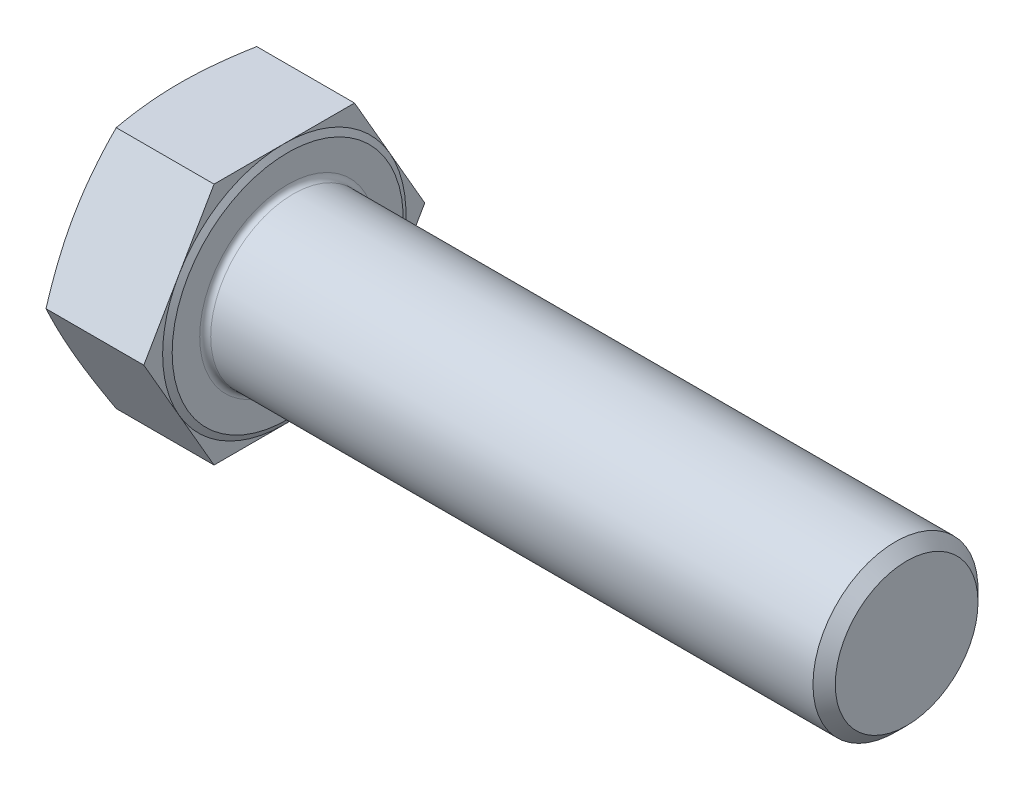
ISO-10303-21;
HEADER;
FILE_DESCRIPTION(('STEP AP214'),'2;1');
FILE_NAME('part.step','',(''),(''),'','','');
FILE_SCHEMA(('AUTOMOTIVE_DESIGN { 1 0 10303 214 1 1 1 1 }'));
ENDSEC;
DATA;
#1=APPLICATION_CONTEXT('core data for automotive mechanical design processes');
#2=APPLICATION_PROTOCOL_DEFINITION('international standard','automotive_design',2000,#1);
#3=PRODUCT_CONTEXT('',#1,'mechanical');
#4=PRODUCT('Part','Part','',(#3));
#5=PRODUCT_RELATED_PRODUCT_CATEGORY('part','',(#4));
#6=PRODUCT_DEFINITION_FORMATION('','',#4);
#7=PRODUCT_DEFINITION_CONTEXT('part definition',#1,'design');
#8=PRODUCT_DEFINITION('design','',#6,#7);
#9=PRODUCT_DEFINITION_SHAPE('','',#8);
#10=(LENGTH_UNIT() NAMED_UNIT(*) SI_UNIT(.MILLI.,.METRE.));
#11=(NAMED_UNIT(*) PLANE_ANGLE_UNIT() SI_UNIT($,.RADIAN.));
#12=(NAMED_UNIT(*) SI_UNIT($,.STERADIAN.) SOLID_ANGLE_UNIT());
#13=UNCERTAINTY_MEASURE_WITH_UNIT(LENGTH_MEASURE(1.E-05),#10,'distance_accuracy_value','');
#14=(GEOMETRIC_REPRESENTATION_CONTEXT(3) GLOBAL_UNCERTAINTY_ASSIGNED_CONTEXT((#13)) GLOBAL_UNIT_ASSIGNED_CONTEXT((#10,
#11,#12)) REPRESENTATION_CONTEXT('',''));
#15=CARTESIAN_POINT('',(0.,0.,0.));
#16=DIRECTION('',(0.,0.,1.));
#17=DIRECTION('',(1.,0.,0.));
#18=AXIS2_PLACEMENT_3D('',#15,#16,#17);
#19=CARTESIAN_POINT('',(15.72,0.,0.));
#20=DIRECTION('',(1.,0.,0.));
#21=DIRECTION('',(0.,0.,-1.));
#22=AXIS2_PLACEMENT_3D('',#19,#20,#21);
#23=PLANE('',#22);
#24=CARTESIAN_POINT('',(15.72,0.,0.));
#25=DIRECTION('',(1.,0.,0.));
#26=DIRECTION('',(0.,0.,-1.));
#27=AXIS2_PLACEMENT_3D('',#24,#25,#26);
#28=CIRCLE('',#27,12.8);
#29=CARTESIAN_POINT('',(15.72,0.,-12.8));
#30=VERTEX_POINT('',#29);
#31=EDGE_CURVE('E188',#30,#30,#28,.F.);
#32=ORIENTED_EDGE('',*,*,#31,.T.);
#33=EDGE_LOOP('',(#32));
#34=FACE_BOUND('',#33,.T.);
#35=CARTESIAN_POINT('',(15.72,0.,0.));
#36=DIRECTION('',(-1.,0.,0.));
#37=DIRECTION('',(0.,0.,1.));
#38=AXIS2_PLACEMENT_3D('',#35,#36,#37);
#39=CIRCLE('',#38,16.805);
#40=CARTESIAN_POINT('',(15.72,0.,16.805));
#41=VERTEX_POINT('',#40);
#42=EDGE_CURVE('E138',#41,#41,#39,.T.);
#43=ORIENTED_EDGE('',*,*,#42,.F.);
#44=EDGE_LOOP('',(#43));
#45=FACE_BOUND('',#44,.T.);
#46=ADVANCED_FACE('F33',(#34,#45),#23,.T.);
#47=CARTESIAN_POINT('',(15.22,-35.38,0.));
#48=DIRECTION('',(-1.,0.,0.));
#49=DIRECTION('',(0.,0.,1.));
#50=AXIS2_PLACEMENT_3D('',#47,#48,#49);
#51=PLANE('',#50);
#52=DIRECTION('',(0.,-0.866025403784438,0.5));
#53=VECTOR('',#52,1.);
#54=CARTESIAN_POINT('',(15.22,17.69,10.2133262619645));
#55=LINE('',#54,#53);
#56=CARTESIAN_POINT('',(15.22,17.69,10.2133262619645));
#57=VERTEX_POINT('',#56);
#58=CARTESIAN_POINT('',(15.22,8.845,15.3199893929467));
#59=VERTEX_POINT('',#58);
#60=EDGE_CURVE('E137',#57,#59,#55,.T.);
#61=ORIENTED_EDGE('',*,*,#60,.T.);
#62=CARTESIAN_POINT('',(15.22,0.,0.));
#63=DIRECTION('',(-1.,0.,0.));
#64=DIRECTION('',(0.,0.,1.));
#65=AXIS2_PLACEMENT_3D('',#62,#63,#64);
#66=CIRCLE('',#65,17.69);
#67=CARTESIAN_POINT('',(15.22,17.69,0.));
#68=VERTEX_POINT('',#67);
#69=EDGE_CURVE('E49',#59,#68,#66,.T.);
#70=ORIENTED_EDGE('',*,*,#69,.T.);
#71=DIRECTION('',(0.,0.,1.));
#72=VECTOR('',#71,1.);
#73=CARTESIAN_POINT('',(15.22,17.69,-10.2133262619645));
#74=LINE('',#73,#72);
#75=EDGE_CURVE('E134',#68,#57,#74,.T.);
#76=ORIENTED_EDGE('',*,*,#75,.T.);
#77=EDGE_LOOP('',(#61,#70,#76));
#78=FACE_BOUND('',#77,.T.);
#79=ADVANCED_FACE('F133',(#78),#51,.F.);
#80=CARTESIAN_POINT('',(15.22,17.69,-10.2133262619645));
#81=VERTEX_POINT('',#80);
#82=EDGE_CURVE('E145',#81,#68,#74,.T.);
#83=ORIENTED_EDGE('',*,*,#82,.T.);
#84=CARTESIAN_POINT('',(15.22,8.845,-15.3199893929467));
#85=VERTEX_POINT('',#84);
#86=EDGE_CURVE('E121',#68,#85,#66,.T.);
#87=ORIENTED_EDGE('',*,*,#86,.T.);
#88=DIRECTION('',(0.,0.866025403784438,0.5));
#89=VECTOR('',#88,1.);
#90=CARTESIAN_POINT('',(15.22,0.,-20.426652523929));
#91=LINE('',#90,#89);
#92=EDGE_CURVE('E151',#85,#81,#91,.T.);
#93=ORIENTED_EDGE('',*,*,#92,.T.);
#94=EDGE_LOOP('',(#83,#87,#93));
#95=FACE_BOUND('',#94,.T.);
#96=ADVANCED_FACE('F150',(#95),#51,.F.);
#97=CARTESIAN_POINT('',(15.22,0.,-20.426652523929));
#98=VERTEX_POINT('',#97);
#99=EDGE_CURVE('E148',#98,#85,#91,.T.);
#100=ORIENTED_EDGE('',*,*,#99,.T.);
#101=CARTESIAN_POINT('',(15.22,-8.845,-15.3199893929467));
#102=VERTEX_POINT('',#101);
#103=EDGE_CURVE('E124',#85,#102,#66,.T.);
#104=ORIENTED_EDGE('',*,*,#103,.T.);
#105=DIRECTION('',(0.,0.866025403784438,-0.5));
#106=VECTOR('',#105,1.);
#107=CARTESIAN_POINT('',(15.22,-17.69,-10.2133262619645));
#108=LINE('',#107,#106);
#109=EDGE_CURVE('E348',#102,#98,#108,.T.);
#110=ORIENTED_EDGE('',*,*,#109,.T.);
#111=EDGE_LOOP('',(#100,#104,#110));
#112=FACE_BOUND('',#111,.T.);
#113=ADVANCED_FACE('F302',(#112),#51,.F.);
#114=CARTESIAN_POINT('',(15.22,-17.69,-10.2133262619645));
#115=VERTEX_POINT('',#114);
#116=EDGE_CURVE('E316',#115,#102,#108,.T.);
#117=ORIENTED_EDGE('',*,*,#116,.T.);
#118=CARTESIAN_POINT('',(15.22,-17.69,0.));
#119=VERTEX_POINT('',#118);
#120=EDGE_CURVE('E317',#102,#119,#66,.T.);
#121=ORIENTED_EDGE('',*,*,#120,.T.);
#122=DIRECTION('',(0.,0.,-1.));
#123=VECTOR('',#122,1.);
#124=CARTESIAN_POINT('',(15.22,-17.69,10.2133262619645));
#125=LINE('',#124,#123);
#126=EDGE_CURVE('E162',#119,#115,#125,.T.);
#127=ORIENTED_EDGE('',*,*,#126,.T.);
#128=EDGE_LOOP('',(#117,#121,#127));
#129=FACE_BOUND('',#128,.T.);
#130=ADVANCED_FACE('F295',(#129),#51,.F.);
#131=CARTESIAN_POINT('',(15.22,-17.69,10.2133262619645));
#132=VERTEX_POINT('',#131);
#133=EDGE_CURVE('E163',#132,#119,#125,.T.);
#134=ORIENTED_EDGE('',*,*,#133,.T.);
#135=CARTESIAN_POINT('',(15.22,-8.84500000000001,15.3199893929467));
#136=VERTEX_POINT('',#135);
#137=EDGE_CURVE('E306',#119,#136,#66,.T.);
#138=ORIENTED_EDGE('',*,*,#137,.T.);
#139=DIRECTION('',(0.,-0.866025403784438,-0.500000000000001));
#140=VECTOR('',#139,1.);
#141=CARTESIAN_POINT('',(15.22,0.,20.426652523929));
#142=LINE('',#141,#140);
#143=EDGE_CURVE('E158',#136,#132,#142,.T.);
#144=ORIENTED_EDGE('',*,*,#143,.T.);
#145=EDGE_LOOP('',(#134,#138,#144));
#146=FACE_BOUND('',#145,.T.);
#147=ADVANCED_FACE('F287',(#146),#51,.F.);
#148=CARTESIAN_POINT('',(15.22,-17.69,-10.2133262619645));
#149=DIRECTION('',(0.,0.5,0.866025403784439));
#150=DIRECTION('',(0.,-0.866025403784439,0.5));
#151=AXIS2_PLACEMENT_3D('',#148,#149,#150);
#152=PLANE('',#151);
#153=CARTESIAN_POINT('',(0.996102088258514,0.00020000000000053,-20.4267679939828));
#154=CARTESIAN_POINT('',(0.919123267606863,-0.36615036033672,-20.2152555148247));
#155=CARTESIAN_POINT('',(0.845606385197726,-0.733039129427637,-20.0034321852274));
#156=CARTESIAN_POINT('',(0.706258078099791,-1.46794347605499,-19.5791349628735));
#157=CARTESIAN_POINT('',(0.640427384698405,-1.83595915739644,-19.366661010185));
#158=CARTESIAN_POINT('',(0.455543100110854,-2.94217643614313,-18.7279861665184));
#159=CARTESIAN_POINT('',(0.349205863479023,-3.68204182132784,-18.3008246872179));
#160=CARTESIAN_POINT('',(0.219971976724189,-4.7909114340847,-17.6606185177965));
#161=CARTESIAN_POINT('',(0.182048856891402,-5.15863629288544,-17.4483124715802));
#162=CARTESIAN_POINT('',(0.116558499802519,-5.89477259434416,-17.0233039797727));
#163=CARTESIAN_POINT('',(0.0889908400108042,-6.26318400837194,-16.8106015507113));
#164=CARTESIAN_POINT('',(0.0446929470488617,-7.00036960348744,-16.3849872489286));
#165=CARTESIAN_POINT('',(0.0279590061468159,-7.36914361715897,-16.1720754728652));
#166=CARTESIAN_POINT('',(0.00561254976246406,-8.10694508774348,-15.7461055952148));
#167=CARTESIAN_POINT('',(0.,-8.47597254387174,-15.5330474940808));
#168=CARTESIAN_POINT('',(0.,-9.21402745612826,-15.1069312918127));
#169=CARTESIAN_POINT('',(0.00561254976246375,-9.58305491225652,-14.8938731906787));
#170=CARTESIAN_POINT('',(0.0279590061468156,-10.320856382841,-14.4679033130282));
#171=CARTESIAN_POINT('',(0.0446929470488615,-10.6896303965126,-14.2549915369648));
#172=CARTESIAN_POINT('',(0.0889908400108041,-11.4268159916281,-13.8293772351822));
#173=CARTESIAN_POINT('',(0.116558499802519,-11.7952274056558,-13.6166748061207));
#174=CARTESIAN_POINT('',(0.182048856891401,-12.5313637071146,-13.1916663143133));
#175=CARTESIAN_POINT('',(0.219971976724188,-12.8990885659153,-12.979360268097));
#176=CARTESIAN_POINT('',(0.349205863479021,-14.0079581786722,-12.3391540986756));
#177=CARTESIAN_POINT('',(0.455543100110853,-14.7478235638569,-11.9119926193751));
#178=CARTESIAN_POINT('',(0.640427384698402,-15.8540408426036,-11.2733177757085));
#179=CARTESIAN_POINT('',(0.706258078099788,-16.222056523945,-11.06084382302));
#180=CARTESIAN_POINT('',(0.845606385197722,-16.9569608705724,-10.6365466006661));
#181=CARTESIAN_POINT('',(0.919123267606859,-17.3238496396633,-10.4247232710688));
#182=CARTESIAN_POINT('',(0.996102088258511,-17.6902,-10.2132107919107));
#183=B_SPLINE_CURVE_WITH_KNOTS('',3,(#153,#154,#155,#156,#157,#158,#159,#160,#161,#162,#163,
#164,#165,#166,#167,#168,#169,#170,#171,#172,#173,#174,#175,#176,#177,#178,#179,#180,#181,#182),
.UNSPECIFIED.,.F.,.F.,(4,2,2,2,2,2,2,2,2,2,2,2,2,2,4),(0.,1.28987745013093,2.57987752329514,
5.16166096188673,6.44046679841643,7.71922044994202,8.9975362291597,10.2758480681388,
11.554159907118,12.8324756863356,14.1112293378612,15.3900351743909,17.9718186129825,
19.2618186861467,20.5516961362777),.UNSPECIFIED.);
#184=CARTESIAN_POINT('',(0.996060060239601,0.,-20.426652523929));
#185=VERTEX_POINT('',#184);
#186=CARTESIAN_POINT('',(0.,-8.84500000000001,-15.3199893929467));
#187=VERTEX_POINT('',#186);
#188=EDGE_CURVE('E332',#185,#187,#183,.T.);
#189=ORIENTED_EDGE('',*,*,#188,.F.);
#190=DIRECTION('',(-1.,0.,0.));
#191=VECTOR('',#190,1.);
#192=CARTESIAN_POINT('',(15.22,0.,-20.426652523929));
#193=LINE('',#192,#191);
#194=EDGE_CURVE('E178',#98,#185,#193,.T.);
#195=ORIENTED_EDGE('',*,*,#194,.F.);
#196=ORIENTED_EDGE('',*,*,#109,.F.);
#197=ORIENTED_EDGE('',*,*,#116,.F.);
#198=DIRECTION('',(-1.,0.,0.));
#199=VECTOR('',#198,1.);
#200=CARTESIAN_POINT('',(15.22,-17.69,-10.2133262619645));
#201=LINE('',#200,#199);
#202=CARTESIAN_POINT('',(0.996060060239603,-17.69,-10.2133262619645));
#203=VERTEX_POINT('',#202);
#204=EDGE_CURVE('E166',#115,#203,#201,.T.);
#205=ORIENTED_EDGE('',*,*,#204,.T.);
#206=EDGE_CURVE('E245',#187,#203,#183,.T.);
#207=ORIENTED_EDGE('',*,*,#206,.F.);
#208=EDGE_LOOP('',(#189,#195,#196,#197,#205,#207));
#209=FACE_BOUND('',#208,.T.);
#210=ADVANCED_FACE('F35',(#209),#152,.F.);
#211=CARTESIAN_POINT('',(15.22,0.,-20.426652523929));
#212=DIRECTION('',(0.,-0.5,0.866025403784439));
#213=DIRECTION('',(0.,-0.866025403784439,-0.5));
#214=AXIS2_PLACEMENT_3D('',#211,#212,#213);
#215=PLANE('',#214);
#216=CARTESIAN_POINT('',(0.996102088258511,17.6902,-10.2132107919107));
#217=CARTESIAN_POINT('',(0.919123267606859,17.3238496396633,-10.4247232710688));
#218=CARTESIAN_POINT('',(0.845606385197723,16.9569608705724,-10.6365466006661));
#219=CARTESIAN_POINT('',(0.706258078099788,16.222056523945,-11.06084382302));
#220=CARTESIAN_POINT('',(0.640427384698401,15.8540408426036,-11.2733177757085));
#221=CARTESIAN_POINT('',(0.455543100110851,14.7478235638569,-11.9119926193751));
#222=CARTESIAN_POINT('',(0.349205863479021,14.0079581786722,-12.3391540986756));
#223=CARTESIAN_POINT('',(0.219971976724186,12.8990885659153,-12.979360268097));
#224=CARTESIAN_POINT('',(0.182048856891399,12.5313637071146,-13.1916663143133));
#225=CARTESIAN_POINT('',(0.116558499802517,11.7952274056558,-13.6166748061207));
#226=CARTESIAN_POINT('',(0.0889908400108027,11.4268159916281,-13.8293772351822));
#227=CARTESIAN_POINT('',(0.0446929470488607,10.6896303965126,-14.2549915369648));
#228=CARTESIAN_POINT('',(0.0279590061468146,10.320856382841,-14.4679033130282));
#229=CARTESIAN_POINT('',(0.00561254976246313,9.58305491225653,-14.8938731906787));
#230=CARTESIAN_POINT('',(0.,9.21402745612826,-15.1069312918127));
#231=CARTESIAN_POINT('',(0.,8.47597254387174,-15.5330474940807));
#232=CARTESIAN_POINT('',(0.0056125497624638,8.10694508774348,-15.7461055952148));
#233=CARTESIAN_POINT('',(0.0279590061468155,7.36914361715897,-16.1720754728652));
#234=CARTESIAN_POINT('',(0.0446929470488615,7.00036960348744,-16.3849872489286));
#235=CARTESIAN_POINT('',(0.0889908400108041,6.26318400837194,-16.8106015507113));
#236=CARTESIAN_POINT('',(0.116558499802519,5.89477259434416,-17.0233039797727));
#237=CARTESIAN_POINT('',(0.182048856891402,5.15863629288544,-17.4483124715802));
#238=CARTESIAN_POINT('',(0.219971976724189,4.7909114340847,-17.6606185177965));
#239=CARTESIAN_POINT('',(0.349205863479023,3.68204182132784,-18.3008246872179));
#240=CARTESIAN_POINT('',(0.455543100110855,2.94217643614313,-18.7279861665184));
#241=CARTESIAN_POINT('',(0.640427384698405,1.83595915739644,-19.366661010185));
#242=CARTESIAN_POINT('',(0.706258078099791,1.46794347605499,-19.5791349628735));
#243=CARTESIAN_POINT('',(0.845606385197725,0.733039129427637,-20.0034321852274));
#244=CARTESIAN_POINT('',(0.919123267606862,0.36615036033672,-20.2152555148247));
#245=CARTESIAN_POINT('',(0.996102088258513,-0.000199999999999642,-20.4267679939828));
#246=B_SPLINE_CURVE_WITH_KNOTS('',3,(#216,#217,#218,#219,#220,#221,#222,#223,#224,#225,#226,
#227,#228,#229,#230,#231,#232,#233,#234,#235,#236,#237,#238,#239,#240,#241,#242,#243,#244,#245),
.UNSPECIFIED.,.F.,.F.,(4,2,2,2,2,2,2,2,2,2,2,2,2,2,4),(0.,1.28987745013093,2.57987752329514,
5.16166096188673,6.44046679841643,7.71922044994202,8.9975362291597,10.2758480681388,
11.554159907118,12.8324756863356,14.1112293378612,15.3900351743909,17.9718186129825,
19.2618186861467,20.5516961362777),.UNSPECIFIED.);
#247=CARTESIAN_POINT('',(0.996060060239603,17.69,-10.2133262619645));
#248=VERTEX_POINT('',#247);
#249=CARTESIAN_POINT('',(0.,8.84500000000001,-15.3199893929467));
#250=VERTEX_POINT('',#249);
#251=EDGE_CURVE('E260',#248,#250,#246,.T.);
#252=ORIENTED_EDGE('',*,*,#251,.F.);
#253=DIRECTION('',(-1.,0.,0.));
#254=VECTOR('',#253,1.);
#255=CARTESIAN_POINT('',(15.22,17.69,-10.2133262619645));
#256=LINE('',#255,#254);
#257=EDGE_CURVE('E176',#81,#248,#256,.T.);
#258=ORIENTED_EDGE('',*,*,#257,.F.);
#259=ORIENTED_EDGE('',*,*,#92,.F.);
#260=ORIENTED_EDGE('',*,*,#99,.F.);
#261=ORIENTED_EDGE('',*,*,#194,.T.);
#262=EDGE_CURVE('E256',#250,#185,#246,.T.);
#263=ORIENTED_EDGE('',*,*,#262,.F.);
#264=EDGE_LOOP('',(#252,#258,#259,#260,#261,#263));
#265=FACE_BOUND('',#264,.T.);
#266=ADVANCED_FACE('F266',(#265),#215,.F.);
#267=CARTESIAN_POINT('',(15.22,17.69,-10.2133262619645));
#268=DIRECTION('',(0.,-1.,0.));
#269=DIRECTION('',(0.,0.,-1.));
#270=AXIS2_PLACEMENT_3D('',#267,#268,#269);
#271=PLANE('',#270);
#272=CARTESIAN_POINT('',(5.32254994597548,17.69,-27.0412966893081));
#273=CARTESIAN_POINT('',(5.20066556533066,17.69,-26.64112277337));
#274=CARTESIAN_POINT('',(5.07951828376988,17.69,-26.2407244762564));
#275=CARTESIAN_POINT('',(4.83886293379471,17.69,-25.4394331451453));
#276=CARTESIAN_POINT('',(4.71935487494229,17.69,-25.0385401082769));
#277=CARTESIAN_POINT('',(4.36352164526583,17.69,-23.8349976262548));
#278=CARTESIAN_POINT('',(4.12990548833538,17.69,-23.0315439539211));
#279=CARTESIAN_POINT('',(3.67113367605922,17.69,-21.4205977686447));
#280=CARTESIAN_POINT('',(3.44599461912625,17.69,-20.613100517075));
#281=CARTESIAN_POINT('',(3.00679348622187,17.69,-18.9951026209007));
#282=CARTESIAN_POINT('',(2.7927312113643,17.69,-18.184602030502));
#283=CARTESIAN_POINT('',(2.38098718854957,17.69,-16.5700722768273));
#284=CARTESIAN_POINT('',(2.18313601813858,17.69,-15.7660865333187));
#285=CARTESIAN_POINT('',(1.80427806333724,17.69,-14.1541143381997));
#286=CARTESIAN_POINT('',(1.62327156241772,17.69,-13.3461278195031));
#287=CARTESIAN_POINT('',(1.28232330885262,17.69,-11.7259732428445));
#288=CARTESIAN_POINT('',(1.12237437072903,17.69,-10.9138067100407));
#289=CARTESIAN_POINT('',(0.828411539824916,17.69,-9.28475845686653));
#290=CARTESIAN_POINT('',(0.694396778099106,17.69,-8.46787689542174));
#291=CARTESIAN_POINT('',(0.47101607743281,17.69,-6.92138265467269));
#292=CARTESIAN_POINT('',(0.378328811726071,17.69,-6.19225422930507));
#293=CARTESIAN_POINT('',(0.221431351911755,17.69,-4.73091426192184));
#294=CARTESIAN_POINT('',(0.157220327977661,17.69,-3.99870281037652));
#295=CARTESIAN_POINT('',(0.0603676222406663,17.69,-2.53268198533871));
#296=CARTESIAN_POINT('',(0.0277036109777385,17.69,-1.79887411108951));
#297=CARTESIAN_POINT('',(-0.0044012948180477,17.69,-0.330524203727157));
#298=CARTESIAN_POINT('',(-0.00384242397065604,17.69,0.404017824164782));
#299=CARTESIAN_POINT('',(0.030555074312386,17.69,1.87603656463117));
#300=CARTESIAN_POINT('',(0.064562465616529,17.69,2.61350926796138));
#301=CARTESIAN_POINT('',(0.164291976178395,17.69,4.08628853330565));
#302=CARTESIAN_POINT('',(0.230014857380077,17.69,4.82159504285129));
#303=CARTESIAN_POINT('',(0.390100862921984,17.69,6.2896788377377));
#304=CARTESIAN_POINT('',(0.484488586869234,17.69,7.0224534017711));
#305=CARTESIAN_POINT('',(0.698075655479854,17.69,8.48433663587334));
#306=CARTESIAN_POINT('',(0.817275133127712,17.69,9.21344528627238));
#307=CARTESIAN_POINT('',(1.08346543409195,17.69,10.7063636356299));
#308=CARTESIAN_POINT('',(1.23159277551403,17.69,11.4699688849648));
#309=CARTESIAN_POINT('',(1.54691232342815,17.69,12.9932580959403));
#310=CARTESIAN_POINT('',(1.71410596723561,17.69,13.7529417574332));
#311=CARTESIAN_POINT('',(2.0640473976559,17.69,15.2689291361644));
#312=CARTESIAN_POINT('',(2.24679970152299,17.69,16.0252318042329));
#313=CARTESIAN_POINT('',(2.62488561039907,17.69,17.5346511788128));
#314=CARTESIAN_POINT('',(2.82021891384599,17.69,18.2877679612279));
#315=CARTESIAN_POINT('',(3.22137256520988,17.69,19.792229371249));
#316=CARTESIAN_POINT('',(3.42720605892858,17.69,20.5435704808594));
#317=CARTESIAN_POINT('',(3.84724615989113,17.69,22.0439053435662));
#318=CARTESIAN_POINT('',(4.06145280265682,17.69,22.7928990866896));
#319=CARTESIAN_POINT('',(4.49670654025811,17.69,24.2887557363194));
#320=CARTESIAN_POINT('',(4.71775248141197,17.69,25.0356189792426));
#321=CARTESIAN_POINT('',(5.16553110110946,17.69,26.5276341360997));
#322=CARTESIAN_POINT('',(5.39226376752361,17.69,27.27278605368));
#323=CARTESIAN_POINT('',(5.84793743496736,17.69,28.7534099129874));
#324=CARTESIAN_POINT('',(6.07682640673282,17.69,29.4888978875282));
#325=CARTESIAN_POINT('',(6.53850831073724,17.69,30.958648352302));
#326=CARTESIAN_POINT('',(6.77130125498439,17.69,31.6929108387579));
#327=CARTESIAN_POINT('',(7.47463001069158,17.69,33.894187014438));
#328=CARTESIAN_POINT('',(7.95009616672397,17.69,35.3596261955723));
#329=CARTESIAN_POINT('',(8.66958601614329,17.69,37.5526335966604));
#330=CARTESIAN_POINT('',(8.90999982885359,17.69,38.2813921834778));
#331=CARTESIAN_POINT('',(9.39290673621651,17.69,39.7382212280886));
#332=CARTESIAN_POINT('',(9.63539983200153,17.69,40.466291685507));
#333=CARTESIAN_POINT('',(10.1221661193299,17.69,41.9217705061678));
#334=CARTESIAN_POINT('',(10.366439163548,17.69,42.6491789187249));
#335=CARTESIAN_POINT('',(10.8565658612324,17.69,44.1034611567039));
#336=CARTESIAN_POINT('',(11.102419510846,17.69,44.8303349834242));
#337=CARTESIAN_POINT('',(11.3489545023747,17.69,45.556977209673));
#338=B_SPLINE_CURVE_WITH_KNOTS('',3,(#272,#273,#274,#275,#276,#277,#278,#279,#280,#281,#282,
#283,#284,#285,#286,#287,#288,#289,#290,#291,#292,#293,#294,#295,#296,#297,#298,#299,#300,#301,
#302,#303,#304,#305,#306,#307,#308,#309,#310,#311,#312,#313,#314,#315,#316,#317,#318,#319,#320,
#321,#322,#323,#324,#325,#326,#327,#328,#329,#330,#331,#332,#333,#334,#335,#336,#337),
.UNSPECIFIED.,.F.,.F.,(4,2,2,2,2,2,2,2,2,2,2,2,2,2,2,2,2,2,2,2,2,2,2,2,2,2,2,2,2,2,2,2,4),(0.,
1.25497065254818,2.50994862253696,5.02009008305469,7.53491484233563,10.0496944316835,
12.53346810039,15.0172835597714,17.5002492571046,19.9831317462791,22.1876358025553,
24.3920756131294,26.5949539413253,28.7978167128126,31.0118513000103,33.2259390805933,
35.4419323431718,37.6579374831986,39.9911583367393,42.3245551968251,44.6586318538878,
46.9926525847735,49.3296707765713,51.6666988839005,54.0033348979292,56.339965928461,
58.6507957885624,60.9616327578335,65.5835052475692,67.8856747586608,70.1878455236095,
72.4898278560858,74.7918045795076),.UNSPECIFIED.);
#339=CARTESIAN_POINT('',(0.996060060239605,17.6900000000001,10.2133262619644));
#340=VERTEX_POINT('',#339);
#341=CARTESIAN_POINT('',(0.,17.69,0.));
#342=VERTEX_POINT('',#341);
#343=EDGE_CURVE('E349',#340,#342,#338,.F.);
#344=ORIENTED_EDGE('',*,*,#343,.F.);
#345=DIRECTION('',(-1.,0.,0.));
#346=VECTOR('',#345,1.);
#347=CARTESIAN_POINT('',(15.22,17.69,10.2133262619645));
#348=LINE('',#347,#346);
#349=EDGE_CURVE('E147',#57,#340,#348,.T.);
#350=ORIENTED_EDGE('',*,*,#349,.F.);
#351=ORIENTED_EDGE('',*,*,#75,.F.);
#352=ORIENTED_EDGE('',*,*,#82,.F.);
#353=ORIENTED_EDGE('',*,*,#257,.T.);
#354=EDGE_CURVE('E261',#342,#248,#338,.F.);
#355=ORIENTED_EDGE('',*,*,#354,.F.);
#356=EDGE_LOOP('',(#344,#350,#351,#352,#353,#355));
#357=FACE_BOUND('',#356,.T.);
#358=ADVANCED_FACE('F143',(#357),#271,.F.);
#359=CARTESIAN_POINT('',(15.22,17.69,10.2133262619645));
#360=DIRECTION('',(0.,-0.5,-0.866025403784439));
#361=DIRECTION('',(0.,0.866025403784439,-0.5));
#362=AXIS2_PLACEMENT_3D('',#359,#360,#361);
#363=PLANE('',#362);
#364=CARTESIAN_POINT('',(0.996102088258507,-0.000199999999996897,20.4267679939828));
#365=CARTESIAN_POINT('',(0.919123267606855,0.366150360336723,20.2152555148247));
#366=CARTESIAN_POINT('',(0.845606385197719,0.733039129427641,20.0034321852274));
#367=CARTESIAN_POINT('',(0.706258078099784,1.46794347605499,19.5791349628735));
#368=CARTESIAN_POINT('',(0.640427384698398,1.83595915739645,19.366661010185));
#369=CARTESIAN_POINT('',(0.455543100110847,2.94217643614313,18.7279861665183));
#370=CARTESIAN_POINT('',(0.349205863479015,3.68204182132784,18.3008246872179));
#371=CARTESIAN_POINT('',(0.219971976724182,4.79091143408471,17.6606185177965));
#372=CARTESIAN_POINT('',(0.182048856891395,5.15863629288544,17.4483124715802));
#373=CARTESIAN_POINT('',(0.116558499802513,5.89477259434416,17.0233039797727));
#374=CARTESIAN_POINT('',(0.0889908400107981,6.26318400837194,16.8106015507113));
#375=CARTESIAN_POINT('',(0.0446929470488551,7.00036960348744,16.3849872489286));
#376=CARTESIAN_POINT('',(0.0279590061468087,7.36914361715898,16.1720754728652));
#377=CARTESIAN_POINT('',(0.00561254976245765,8.10694508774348,15.7461055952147));
#378=CARTESIAN_POINT('',(0.,8.47597254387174,15.5330474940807));
#379=CARTESIAN_POINT('',(0.,9.21402745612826,15.1069312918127));
#380=CARTESIAN_POINT('',(0.00561254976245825,9.58305491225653,14.8938731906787));
#381=CARTESIAN_POINT('',(0.0279590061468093,10.320856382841,14.4679033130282));
#382=CARTESIAN_POINT('',(0.0446929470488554,10.6896303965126,14.2549915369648));
#383=CARTESIAN_POINT('',(0.0889908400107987,11.4268159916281,13.8293772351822));
#384=CARTESIAN_POINT('',(0.116558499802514,11.7952274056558,13.6166748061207));
#385=CARTESIAN_POINT('',(0.182048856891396,12.5313637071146,13.1916663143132));
#386=CARTESIAN_POINT('',(0.219971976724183,12.8990885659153,12.9793602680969));
#387=CARTESIAN_POINT('',(0.349205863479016,14.0079581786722,12.3391540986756));
#388=CARTESIAN_POINT('',(0.455543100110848,14.7478235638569,11.9119926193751));
#389=CARTESIAN_POINT('',(0.640427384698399,15.8540408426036,11.2733177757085));
#390=CARTESIAN_POINT('',(0.706258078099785,16.222056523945,11.06084382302));
#391=CARTESIAN_POINT('',(0.845606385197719,16.9569608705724,10.636546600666));
#392=CARTESIAN_POINT('',(0.919123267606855,17.3238496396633,10.4247232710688));
#393=CARTESIAN_POINT('',(0.996102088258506,17.6902,10.2132107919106));
#394=B_SPLINE_CURVE_WITH_KNOTS('',3,(#364,#365,#366,#367,#368,#369,#370,#371,#372,#373,#374,
#375,#376,#377,#378,#379,#380,#381,#382,#383,#384,#385,#386,#387,#388,#389,#390,#391,#392,#393),
.UNSPECIFIED.,.F.,.F.,(4,2,2,2,2,2,2,2,2,2,2,2,2,2,4),(0.,1.28987745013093,2.57987752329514,
5.16166096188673,6.44046679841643,7.71922044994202,8.9975362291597,10.2758480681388,
11.554159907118,12.8324756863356,14.1112293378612,15.3900351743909,17.9718186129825,
19.2618186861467,20.5516961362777),.UNSPECIFIED.);
#395=CARTESIAN_POINT('',(0.996060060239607,0.,20.426652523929));
#396=VERTEX_POINT('',#395);
#397=CARTESIAN_POINT('',(0.,8.845,15.3199893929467));
#398=VERTEX_POINT('',#397);
#399=EDGE_CURVE('E250',#396,#398,#394,.T.);
#400=ORIENTED_EDGE('',*,*,#399,.F.);
#401=DIRECTION('',(-1.,0.,0.));
#402=VECTOR('',#401,1.);
#403=CARTESIAN_POINT('',(15.22,0.,20.426652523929));
#404=LINE('',#403,#402);
#405=CARTESIAN_POINT('',(15.22,0.,20.426652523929));
#406=VERTEX_POINT('',#405);
#407=EDGE_CURVE('E172',#406,#396,#404,.T.);
#408=ORIENTED_EDGE('',*,*,#407,.F.);
#409=EDGE_CURVE('E153',#59,#406,#55,.T.);
#410=ORIENTED_EDGE('',*,*,#409,.F.);
#411=ORIENTED_EDGE('',*,*,#60,.F.);
#412=ORIENTED_EDGE('',*,*,#349,.T.);
#413=EDGE_CURVE('E335',#398,#340,#394,.T.);
#414=ORIENTED_EDGE('',*,*,#413,.F.);
#415=EDGE_LOOP('',(#400,#408,#410,#411,#412,#414));
#416=FACE_BOUND('',#415,.T.);
#417=ADVANCED_FACE('F272',(#416),#363,.F.);
#418=CARTESIAN_POINT('',(15.22,0.,20.426652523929));
#419=DIRECTION('',(0.,0.500000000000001,-0.866025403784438));
#420=DIRECTION('',(0.,0.866025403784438,0.500000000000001));
#421=AXIS2_PLACEMENT_3D('',#418,#419,#420);
#422=PLANE('',#421);
#423=CARTESIAN_POINT('',(0.996102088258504,-17.6902,10.2132107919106));
#424=CARTESIAN_POINT('',(0.919123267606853,-17.3238496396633,10.4247232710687));
#425=CARTESIAN_POINT('',(0.845606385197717,-16.9569608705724,10.636546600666));
#426=CARTESIAN_POINT('',(0.706258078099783,-16.222056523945,11.06084382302));
#427=CARTESIAN_POINT('',(0.640427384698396,-15.8540408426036,11.2733177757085));
#428=CARTESIAN_POINT('',(0.455543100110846,-14.7478235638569,11.9119926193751));
#429=CARTESIAN_POINT('',(0.349205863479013,-14.0079581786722,12.3391540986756));
#430=CARTESIAN_POINT('',(0.21997197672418,-12.8990885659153,12.9793602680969));
#431=CARTESIAN_POINT('',(0.182048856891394,-12.5313637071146,13.1916663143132));
#432=CARTESIAN_POINT('',(0.116558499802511,-11.7952274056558,13.6166748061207));
#433=CARTESIAN_POINT('',(0.0889908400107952,-11.4268159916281,13.8293772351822));
#434=CARTESIAN_POINT('',(0.0446929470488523,-10.6896303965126,14.2549915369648));
#435=CARTESIAN_POINT('',(0.0279590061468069,-10.320856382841,14.4679033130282));
#436=CARTESIAN_POINT('',(0.00561254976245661,-9.58305491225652,14.8938731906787));
#437=CARTESIAN_POINT('',(0.,-9.21402745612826,15.1069312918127));
#438=CARTESIAN_POINT('',(0.,-8.47597254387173,15.5330474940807));
#439=CARTESIAN_POINT('',(0.00561254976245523,-8.10694508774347,15.7461055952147));
#440=CARTESIAN_POINT('',(0.0279590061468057,-7.36914361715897,16.1720754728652));
#441=CARTESIAN_POINT('',(0.044692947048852,-7.00036960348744,16.3849872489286));
#442=CARTESIAN_POINT('',(0.0889908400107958,-6.26318400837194,16.8106015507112));
#443=CARTESIAN_POINT('',(0.116558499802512,-5.89477259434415,17.0233039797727));
#444=CARTESIAN_POINT('',(0.182048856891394,-5.15863629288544,17.4483124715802));
#445=CARTESIAN_POINT('',(0.219971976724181,-4.7909114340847,17.6606185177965));
#446=CARTESIAN_POINT('',(0.349205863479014,-3.68204182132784,18.3008246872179));
#447=CARTESIAN_POINT('',(0.455543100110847,-2.94217643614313,18.7279861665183));
#448=CARTESIAN_POINT('',(0.640427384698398,-1.83595915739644,19.366661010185));
#449=CARTESIAN_POINT('',(0.706258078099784,-1.46794347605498,19.5791349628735));
#450=CARTESIAN_POINT('',(0.845606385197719,-0.733039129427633,20.0034321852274));
#451=CARTESIAN_POINT('',(0.919123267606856,-0.366150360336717,20.2152555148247));
#452=CARTESIAN_POINT('',(0.996102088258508,0.000200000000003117,20.4267679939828));
#453=B_SPLINE_CURVE_WITH_KNOTS('',3,(#423,#424,#425,#426,#427,#428,#429,#430,#431,#432,#433,
#434,#435,#436,#437,#438,#439,#440,#441,#442,#443,#444,#445,#446,#447,#448,#449,#450,#451,#452),
.UNSPECIFIED.,.F.,.F.,(4,2,2,2,2,2,2,2,2,2,2,2,2,2,4),(0.,1.28987745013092,2.57987752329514,
5.16166096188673,6.44046679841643,7.71922044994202,8.9975362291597,10.2758480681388,
11.554159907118,12.8324756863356,14.1112293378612,15.3900351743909,17.9718186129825,
19.2618186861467,20.5516961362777),.UNSPECIFIED.);
#454=CARTESIAN_POINT('',(0.996060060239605,-17.69,10.2133262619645));
#455=VERTEX_POINT('',#454);
#456=CARTESIAN_POINT('',(0.,-8.84500000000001,15.3199893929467));
#457=VERTEX_POINT('',#456);
#458=EDGE_CURVE('E238',#455,#457,#453,.T.);
#459=ORIENTED_EDGE('',*,*,#458,.F.);
#460=DIRECTION('',(-1.,0.,0.));
#461=VECTOR('',#460,1.);
#462=CARTESIAN_POINT('',(15.22,-17.69,10.2133262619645));
#463=LINE('',#462,#461);
#464=EDGE_CURVE('E169',#132,#455,#463,.T.);
#465=ORIENTED_EDGE('',*,*,#464,.F.);
#466=ORIENTED_EDGE('',*,*,#143,.F.);
#467=EDGE_CURVE('E159',#406,#136,#142,.T.);
#468=ORIENTED_EDGE('',*,*,#467,.F.);
#469=ORIENTED_EDGE('',*,*,#407,.T.);
#470=EDGE_CURVE('E330',#457,#396,#453,.T.);
#471=ORIENTED_EDGE('',*,*,#470,.F.);
#472=EDGE_LOOP('',(#459,#465,#466,#468,#469,#471));
#473=FACE_BOUND('',#472,.T.);
#474=ADVANCED_FACE('F275',(#473),#422,.F.);
#475=CARTESIAN_POINT('',(15.22,-17.69,10.2133262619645));
#476=DIRECTION('',(0.,1.,0.));
#477=DIRECTION('',(0.,0.,1.));
#478=AXIS2_PLACEMENT_3D('',#475,#476,#477);
#479=PLANE('',#478);
#480=CARTESIAN_POINT('',(5.32254994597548,-17.69,-27.0412966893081));
#481=CARTESIAN_POINT('',(5.20066556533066,-17.69,-26.64112277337));
#482=CARTESIAN_POINT('',(5.07951828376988,-17.69,-26.2407244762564));
#483=CARTESIAN_POINT('',(4.83886293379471,-17.69,-25.4394331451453));
#484=CARTESIAN_POINT('',(4.71935487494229,-17.69,-25.0385401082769));
#485=CARTESIAN_POINT('',(4.36352164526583,-17.69,-23.8349976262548));
#486=CARTESIAN_POINT('',(4.12990548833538,-17.69,-23.0315439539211));
#487=CARTESIAN_POINT('',(3.67113367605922,-17.69,-21.4205977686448));
#488=CARTESIAN_POINT('',(3.44599461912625,-17.69,-20.613100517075));
#489=CARTESIAN_POINT('',(3.00679348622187,-17.69,-18.9951026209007));
#490=CARTESIAN_POINT('',(2.7927312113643,-17.69,-18.184602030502));
#491=CARTESIAN_POINT('',(2.38098718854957,-17.69,-16.5700722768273));
#492=CARTESIAN_POINT('',(2.18313601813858,-17.69,-15.7660865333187));
#493=CARTESIAN_POINT('',(1.80427806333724,-17.69,-14.1541143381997));
#494=CARTESIAN_POINT('',(1.62327156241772,-17.69,-13.3461278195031));
#495=CARTESIAN_POINT('',(1.28232330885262,-17.69,-11.7259732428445));
#496=CARTESIAN_POINT('',(1.12237437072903,-17.69,-10.9138067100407));
#497=CARTESIAN_POINT('',(0.828411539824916,-17.69,-9.28475845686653));
#498=CARTESIAN_POINT('',(0.694396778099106,-17.69,-8.46787689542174));
#499=CARTESIAN_POINT('',(0.471016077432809,-17.69,-6.9213826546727));
#500=CARTESIAN_POINT('',(0.378328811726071,-17.69,-6.19225422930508));
#501=CARTESIAN_POINT('',(0.221431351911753,-17.69,-4.73091426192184));
#502=CARTESIAN_POINT('',(0.157220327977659,-17.69,-3.99870281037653));
#503=CARTESIAN_POINT('',(0.0603676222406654,-17.69,-2.53268198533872));
#504=CARTESIAN_POINT('',(0.0277036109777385,-17.69,-1.79887411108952));
#505=CARTESIAN_POINT('',(-0.00440129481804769,-17.69,-0.330524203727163));
#506=CARTESIAN_POINT('',(-0.00384242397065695,-17.69,0.404017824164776));
#507=CARTESIAN_POINT('',(0.0305550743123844,-17.69,1.87603656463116));
#508=CARTESIAN_POINT('',(0.0645624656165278,-17.69,2.61350926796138));
#509=CARTESIAN_POINT('',(0.164291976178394,-17.69,4.08628853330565));
#510=CARTESIAN_POINT('',(0.230014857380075,-17.69,4.82159504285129));
#511=CARTESIAN_POINT('',(0.390100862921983,-17.69,6.2896788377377));
#512=CARTESIAN_POINT('',(0.484488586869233,-17.69,7.0224534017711));
#513=CARTESIAN_POINT('',(0.698075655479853,-17.69,8.48433663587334));
#514=CARTESIAN_POINT('',(0.817275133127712,-17.69,9.21344528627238));
#515=CARTESIAN_POINT('',(1.08346543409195,-17.69,10.7063636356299));
#516=CARTESIAN_POINT('',(1.23159277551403,-17.69,11.4699688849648));
#517=CARTESIAN_POINT('',(1.54691232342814,-17.69,12.9932580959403));
#518=CARTESIAN_POINT('',(1.71410596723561,-17.69,13.7529417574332));
#519=CARTESIAN_POINT('',(2.0640473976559,-17.69,15.2689291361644));
#520=CARTESIAN_POINT('',(2.246799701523,-17.69,16.0252318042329));
#521=CARTESIAN_POINT('',(2.62488561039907,-17.69,17.5346511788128));
#522=CARTESIAN_POINT('',(2.82021891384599,-17.69,18.2877679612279));
#523=CARTESIAN_POINT('',(3.22137256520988,-17.69,19.792229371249));
#524=CARTESIAN_POINT('',(3.42720605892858,-17.69,20.5435704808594));
#525=CARTESIAN_POINT('',(3.84724615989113,-17.69,22.0439053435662));
#526=CARTESIAN_POINT('',(4.06145280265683,-17.69,22.7928990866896));
#527=CARTESIAN_POINT('',(4.49670654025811,-17.69,24.2887557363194));
#528=CARTESIAN_POINT('',(4.71775248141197,-17.69,25.0356189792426));
#529=CARTESIAN_POINT('',(5.16553110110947,-17.69,26.5276341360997));
#530=CARTESIAN_POINT('',(5.39226376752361,-17.69,27.27278605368));
#531=CARTESIAN_POINT('',(5.84793743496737,-17.69,28.7534099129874));
#532=CARTESIAN_POINT('',(6.07682640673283,-17.69,29.4888978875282));
#533=CARTESIAN_POINT('',(6.53850831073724,-17.69,30.958648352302));
#534=CARTESIAN_POINT('',(6.7713012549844,-17.69,31.6929108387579));
#535=CARTESIAN_POINT('',(7.47463001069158,-17.69,33.894187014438));
#536=CARTESIAN_POINT('',(7.95009616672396,-17.69,35.3596261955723));
#537=CARTESIAN_POINT('',(8.66958601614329,-17.69,37.5526335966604));
#538=CARTESIAN_POINT('',(8.90999982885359,-17.69,38.2813921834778));
#539=CARTESIAN_POINT('',(9.39290673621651,-17.69,39.7382212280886));
#540=CARTESIAN_POINT('',(9.63539983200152,-17.69,40.466291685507));
#541=CARTESIAN_POINT('',(10.1221661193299,-17.69,41.9217705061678));
#542=CARTESIAN_POINT('',(10.366439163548,-17.69,42.6491789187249));
#543=CARTESIAN_POINT('',(10.8565658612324,-17.69,44.1034611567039));
#544=CARTESIAN_POINT('',(11.102419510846,-17.69,44.8303349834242));
#545=CARTESIAN_POINT('',(11.3489545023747,-17.69,45.556977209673));
#546=B_SPLINE_CURVE_WITH_KNOTS('',3,(#480,#481,#482,#483,#484,#485,#486,#487,#488,#489,#490,
#491,#492,#493,#494,#495,#496,#497,#498,#499,#500,#501,#502,#503,#504,#505,#506,#507,#508,#509,
#510,#511,#512,#513,#514,#515,#516,#517,#518,#519,#520,#521,#522,#523,#524,#525,#526,#527,#528,
#529,#530,#531,#532,#533,#534,#535,#536,#537,#538,#539,#540,#541,#542,#543,#544,#545),
.UNSPECIFIED.,.F.,.F.,(4,2,2,2,2,2,2,2,2,2,2,2,2,2,2,2,2,2,2,2,2,2,2,2,2,2,2,2,2,2,2,2,4),(0.,
1.25497065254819,2.50994862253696,5.02009008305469,7.53491484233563,10.0496944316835,
12.53346810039,15.0172835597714,17.5002492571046,19.9831317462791,22.1876358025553,
24.3920756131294,26.5949539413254,28.7978167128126,31.0118513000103,33.2259390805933,
35.4419323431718,37.6579374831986,39.9911583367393,42.3245551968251,44.6586318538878,
46.9926525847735,49.3296707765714,51.6666988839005,54.0033348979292,56.339965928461,
58.6507957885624,60.9616327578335,65.5835052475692,67.8856747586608,70.1878455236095,
72.4898278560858,74.7918045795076),.UNSPECIFIED.);
#547=CARTESIAN_POINT('',(0.,-17.69,0.));
#548=VERTEX_POINT('',#547);
#549=EDGE_CURVE('E323',#203,#548,#546,.T.);
#550=ORIENTED_EDGE('',*,*,#549,.F.);
#551=ORIENTED_EDGE('',*,*,#204,.F.);
#552=ORIENTED_EDGE('',*,*,#126,.F.);
#553=ORIENTED_EDGE('',*,*,#133,.F.);
#554=ORIENTED_EDGE('',*,*,#464,.T.);
#555=EDGE_CURVE('E228',#548,#455,#546,.T.);
#556=ORIENTED_EDGE('',*,*,#555,.F.);
#557=EDGE_LOOP('',(#550,#551,#552,#553,#554,#556));
#558=FACE_BOUND('',#557,.T.);
#559=ADVANCED_FACE('F279',(#558),#479,.F.);
#560=ORIENTED_EDGE('',*,*,#467,.T.);
#561=EDGE_CURVE('E139',#136,#59,#66,.T.);
#562=ORIENTED_EDGE('',*,*,#561,.T.);
#563=ORIENTED_EDGE('',*,*,#409,.T.);
#564=EDGE_LOOP('',(#560,#562,#563));
#565=FACE_BOUND('',#564,.T.);
#566=ADVANCED_FACE('F213',(#565),#51,.F.);
#567=CARTESIAN_POINT('',(0.,0.,0.));
#568=DIRECTION('',(1.,0.,0.));
#569=DIRECTION('',(0.,0.,-1.));
#570=AXIS2_PLACEMENT_3D('',#567,#568,#569);
#571=CONICAL_SURFACE('',#570,17.69,1.22173047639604);
#572=ORIENTED_EDGE('',*,*,#399,.T.);
#573=CARTESIAN_POINT('',(0.,0.,0.));
#574=DIRECTION('',(-1.,0.,0.));
#575=DIRECTION('',(0.,0.,1.));
#576=AXIS2_PLACEMENT_3D('',#573,#574,#575);
#577=CIRCLE('',#576,17.69);
#578=EDGE_CURVE('E181',#457,#398,#577,.T.);
#579=ORIENTED_EDGE('',*,*,#578,.F.);
#580=ORIENTED_EDGE('',*,*,#470,.T.);
#581=EDGE_LOOP('',(#572,#579,#580));
#582=FACE_BOUND('',#581,.T.);
#583=ADVANCED_FACE('F285',(#582),#571,.T.);
#584=ORIENTED_EDGE('',*,*,#458,.T.);
#585=EDGE_CURVE('E184',#548,#457,#577,.T.);
#586=ORIENTED_EDGE('',*,*,#585,.F.);
#587=ORIENTED_EDGE('',*,*,#555,.T.);
#588=EDGE_LOOP('',(#584,#586,#587));
#589=FACE_BOUND('',#588,.T.);
#590=ADVANCED_FACE('F224',(#589),#571,.T.);
#591=ORIENTED_EDGE('',*,*,#206,.T.);
#592=ORIENTED_EDGE('',*,*,#549,.T.);
#593=EDGE_CURVE('E344',#187,#548,#577,.T.);
#594=ORIENTED_EDGE('',*,*,#593,.F.);
#595=EDGE_LOOP('',(#591,#592,#594));
#596=FACE_BOUND('',#595,.T.);
#597=ADVANCED_FACE('F292',(#596),#571,.T.);
#598=ORIENTED_EDGE('',*,*,#262,.T.);
#599=ORIENTED_EDGE('',*,*,#188,.T.);
#600=EDGE_CURVE('E340',#250,#187,#577,.T.);
#601=ORIENTED_EDGE('',*,*,#600,.F.);
#602=EDGE_LOOP('',(#598,#599,#601));
#603=FACE_BOUND('',#602,.T.);
#604=ADVANCED_FACE('F293',(#603),#571,.T.);
#605=ORIENTED_EDGE('',*,*,#354,.T.);
#606=ORIENTED_EDGE('',*,*,#251,.T.);
#607=EDGE_CURVE('E185',#342,#250,#577,.T.);
#608=ORIENTED_EDGE('',*,*,#607,.F.);
#609=EDGE_LOOP('',(#605,#606,#608));
#610=FACE_BOUND('',#609,.T.);
#611=ADVANCED_FACE('F223',(#610),#571,.T.);
#612=ORIENTED_EDGE('',*,*,#343,.T.);
#613=CARTESIAN_POINT('',(0.,0.,0.));
#614=DIRECTION('',(-1.,0.,0.));
#615=DIRECTION('',(0.,0.,1.));
#616=AXIS2_PLACEMENT_3D('',#613,#614,#615);
#617=CIRCLE('',#616,17.69);
#618=EDGE_CURVE('E57',#398,#342,#617,.T.);
#619=ORIENTED_EDGE('',*,*,#618,.F.);
#620=ORIENTED_EDGE('',*,*,#413,.T.);
#621=EDGE_LOOP('',(#612,#619,#620));
#622=FACE_BOUND('',#621,.T.);
#623=ADVANCED_FACE('F218',(#622),#571,.T.);
#624=CARTESIAN_POINT('',(0.,-35.38,0.));
#625=DIRECTION('',(-1.,0.,0.));
#626=DIRECTION('',(0.,0.,1.));
#627=AXIS2_PLACEMENT_3D('',#624,#625,#626);
#628=PLANE('',#627);
#629=ORIENTED_EDGE('',*,*,#578,.T.);
#630=ORIENTED_EDGE('',*,*,#618,.T.);
#631=ORIENTED_EDGE('',*,*,#607,.T.);
#632=ORIENTED_EDGE('',*,*,#600,.T.);
#633=ORIENTED_EDGE('',*,*,#593,.T.);
#634=ORIENTED_EDGE('',*,*,#585,.T.);
#635=EDGE_LOOP('',(#629,#630,#631,#632,#633,#634));
#636=FACE_BOUND('',#635,.T.);
#637=ADVANCED_FACE('F222',(#636),#628,.T.);
#638=CARTESIAN_POINT('',(15.22,0.,0.));
#639=DIRECTION('',(-1.,0.,0.));
#640=DIRECTION('',(0.,0.,1.));
#641=AXIS2_PLACEMENT_3D('',#638,#639,#640);
#642=CONICAL_SURFACE('',#641,17.69,1.05653119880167);
#643=ORIENTED_EDGE('',*,*,#42,.T.);
#644=EDGE_LOOP('',(#643));
#645=FACE_BOUND('',#644,.T.);
#646=ORIENTED_EDGE('',*,*,#69,.F.);
#647=ORIENTED_EDGE('',*,*,#561,.F.);
#648=ORIENTED_EDGE('',*,*,#137,.F.);
#649=ORIENTED_EDGE('',*,*,#120,.F.);
#650=ORIENTED_EDGE('',*,*,#103,.F.);
#651=ORIENTED_EDGE('',*,*,#86,.F.);
#652=EDGE_LOOP('',(#646,#647,#648,#649,#650,#651));
#653=FACE_BOUND('',#652,.T.);
#654=ADVANCED_FACE('F122',(#645,#653),#642,.T.);
#655=CARTESIAN_POINT('',(105.72,0.,0.));
#656=DIRECTION('',(-1.,0.,0.));
#657=DIRECTION('',(0.,0.,1.));
#658=AXIS2_PLACEMENT_3D('',#655,#656,#657);
#659=CYLINDRICAL_SURFACE('',#658,12.);
#660=CARTESIAN_POINT('',(104.096,0.,0.));
#661=DIRECTION('',(1.,0.,0.));
#662=DIRECTION('',(0.,0.,-1.));
#663=AXIS2_PLACEMENT_3D('',#660,#661,#662);
#664=CIRCLE('',#663,12.);
#665=CARTESIAN_POINT('',(104.096,0.,12.));
#666=VERTEX_POINT('',#665);
#667=EDGE_CURVE('E11',#666,#666,#664,.F.);
#668=CARTESIAN_POINT('',(16.52,0.,0.));
#669=DIRECTION('',(1.,0.,0.));
#670=DIRECTION('',(0.,0.,-1.));
#671=AXIS2_PLACEMENT_3D('',#668,#669,#670);
#672=CIRCLE('',#671,12.);
#673=CARTESIAN_POINT('',(16.52,0.,12.));
#674=VERTEX_POINT('',#673);
#675=EDGE_CURVE('E128',#674,#674,#672,.T.);
#676=CARTESIAN_POINT('',(104.096,0.,12.));
#677=CARTESIAN_POINT('',(103.18375,0.,12.));
#678=CARTESIAN_POINT('',(102.2715,0.,12.));
#679=CARTESIAN_POINT('',(100.447,0.,12.));
#680=CARTESIAN_POINT('',(99.5347500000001,0.,12.));
#681=CARTESIAN_POINT('',(97.7102500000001,0.,12.));
#682=CARTESIAN_POINT('',(96.7980000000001,0.,12.));
#683=CARTESIAN_POINT('',(94.9735000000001,0.,12.));
#684=CARTESIAN_POINT('',(94.0612500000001,0.,12.));
#685=CARTESIAN_POINT('',(92.2367500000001,0.,12.));
#686=CARTESIAN_POINT('',(91.3245000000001,0.,12.));
#687=CARTESIAN_POINT('',(89.5000000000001,0.,12.));
#688=CARTESIAN_POINT('',(88.5877500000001,0.,12.));
#689=CARTESIAN_POINT('',(86.7632500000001,0.,12.));
#690=CARTESIAN_POINT('',(85.8510000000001,0.,12.));
#691=CARTESIAN_POINT('',(84.0265000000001,0.,12.));
#692=CARTESIAN_POINT('',(83.1142500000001,0.,12.));
#693=CARTESIAN_POINT('',(81.2897500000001,0.,12.));
#694=CARTESIAN_POINT('',(80.3775000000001,0.,12.));
#695=CARTESIAN_POINT('',(78.5530000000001,0.,12.));
#696=CARTESIAN_POINT('',(77.6407500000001,0.,12.));
#697=CARTESIAN_POINT('',(75.8162500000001,0.,12.));
#698=CARTESIAN_POINT('',(74.9040000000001,0.,12.));
#699=CARTESIAN_POINT('',(73.0795000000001,0.,12.));
#700=CARTESIAN_POINT('',(72.1672500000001,0.,12.));
#701=CARTESIAN_POINT('',(70.3427500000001,0.,12.));
#702=CARTESIAN_POINT('',(69.4305000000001,0.,12.));
#703=CARTESIAN_POINT('',(67.6060000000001,0.,12.));
#704=CARTESIAN_POINT('',(66.6937500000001,0.,12.));
#705=CARTESIAN_POINT('',(64.8692500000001,0.,12.));
#706=CARTESIAN_POINT('',(63.9570000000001,0.,12.));
#707=CARTESIAN_POINT('',(62.1325000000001,0.,12.));
#708=CARTESIAN_POINT('',(61.22025,0.,12.));
#709=CARTESIAN_POINT('',(59.39575,0.,12.));
#710=CARTESIAN_POINT('',(58.4835,0.,12.));
#711=CARTESIAN_POINT('',(56.659,0.,12.));
#712=CARTESIAN_POINT('',(55.74675,0.,12.));
#713=CARTESIAN_POINT('',(53.92225,0.,12.));
#714=CARTESIAN_POINT('',(53.01,0.,12.));
#715=CARTESIAN_POINT('',(51.1855,0.,12.));
#716=CARTESIAN_POINT('',(50.27325,0.,12.));
#717=CARTESIAN_POINT('',(48.44875,0.,12.));
#718=CARTESIAN_POINT('',(47.5365,0.,12.));
#719=CARTESIAN_POINT('',(45.712,0.,12.));
#720=CARTESIAN_POINT('',(44.79975,0.,12.));
#721=CARTESIAN_POINT('',(42.97525,0.,12.));
#722=CARTESIAN_POINT('',(42.063,0.,12.));
#723=CARTESIAN_POINT('',(40.2385,0.,12.));
#724=CARTESIAN_POINT('',(39.32625,0.,12.));
#725=CARTESIAN_POINT('',(37.50175,0.,12.));
#726=CARTESIAN_POINT('',(36.5895,0.,12.));
#727=CARTESIAN_POINT('',(34.765,0.,12.));
#728=CARTESIAN_POINT('',(33.85275,0.,12.));
#729=CARTESIAN_POINT('',(32.02825,0.,12.));
#730=CARTESIAN_POINT('',(31.116,0.,12.));
#731=CARTESIAN_POINT('',(29.2915,0.,12.));
#732=CARTESIAN_POINT('',(28.37925,0.,12.));
#733=CARTESIAN_POINT('',(26.55475,0.,12.));
#734=CARTESIAN_POINT('',(25.6425,0.,12.));
#735=CARTESIAN_POINT('',(23.818,0.,12.));
#736=CARTESIAN_POINT('',(22.90575,0.,12.));
#737=CARTESIAN_POINT('',(21.08125,0.,12.));
#738=CARTESIAN_POINT('',(20.169,0.,12.));
#739=CARTESIAN_POINT('',(18.3445,0.,12.));
#740=CARTESIAN_POINT('',(17.43225,0.,12.));
#741=CARTESIAN_POINT('',(16.52,0.,12.));
#742=B_SPLINE_CURVE_WITH_KNOTS('',3,(#676,#677,#678,#679,#680,#681,#682,#683,#684,#685,#686,
#687,#688,#689,#690,#691,#692,#693,#694,#695,#696,#697,#698,#699,#700,#701,#702,#703,#704,#705,
#706,#707,#708,#709,#710,#711,#712,#713,#714,#715,#716,#717,#718,#719,#720,#721,#722,#723,#724,
#725,#726,#727,#728,#729,#730,#731,#732,#733,#734,#735,#736,#737,#738,#739,#740,#741),
.UNSPECIFIED.,.F.,.F.,(4,2,2,2,2,2,2,2,2,2,2,2,2,2,2,2,2,2,2,2,2,2,2,2,2,2,2,2,2,2,2,2,4),(0.,
2.73675,5.47349999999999,8.21025,10.947,13.68375,16.4205,19.15725,21.894,24.63075,27.3675,
30.10425,32.841,35.57775,38.3145,41.05125,43.788,46.52475,49.2615,51.99825,54.735,57.47175,
60.2085,62.94525,65.682,68.41875,71.1555,73.89225,76.629,79.36575,82.1025,84.83925,87.576),.UNSPECIFIED.);
#743=EDGE_CURVE('BSEAM387',#666,#674,#742,.T.);
#744=ORIENTED_EDGE('',*,*,#667,.T.);
#745=ORIENTED_EDGE('',*,*,#675,.T.);
#746=ORIENTED_EDGE('',*,*,#743,.T.);
#747=ORIENTED_EDGE('',*,*,#743,.F.);
#748=EDGE_LOOP('',(#744,#746,#745,#747));
#749=FACE_BOUND('',#748,.T.);
#750=ADVANCED_FACE('F387',(#749),#659,.T.);
#751=CARTESIAN_POINT('',(105.72,0.,0.));
#752=DIRECTION('',(1.,0.,0.));
#753=DIRECTION('',(0.,0.,-1.));
#754=AXIS2_PLACEMENT_3D('',#751,#752,#753);
#755=PLANE('',#754);
#756=CARTESIAN_POINT('',(105.72,0.,0.));
#757=DIRECTION('',(1.,0.,0.));
#758=DIRECTION('',(0.,0.,-1.));
#759=AXIS2_PLACEMENT_3D('',#756,#757,#758);
#760=CIRCLE('',#759,10.376);
#761=CARTESIAN_POINT('',(105.72,0.,-10.3760000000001));
#762=VERTEX_POINT('',#761);
#763=EDGE_CURVE('E42',#762,#762,#760,.T.);
#764=ORIENTED_EDGE('',*,*,#763,.T.);
#765=EDGE_LOOP('',(#764));
#766=FACE_BOUND('',#765,.T.);
#767=ADVANCED_FACE('F193',(#766),#755,.T.);
#768=CARTESIAN_POINT('',(16.52,0.,0.));
#769=DIRECTION('',(1.,0.,0.));
#770=DIRECTION('',(0.,0.,-1.));
#771=AXIS2_PLACEMENT_3D('',#768,#769,#770);
#772=TOROIDAL_SURFACE('',#771,12.8,0.8);
#773=ORIENTED_EDGE('',*,*,#31,.F.);
#774=EDGE_LOOP('',(#773));
#775=FACE_BOUND('',#774,.T.);
#776=ORIENTED_EDGE('',*,*,#675,.F.);
#777=EDGE_LOOP('',(#776));
#778=FACE_BOUND('',#777,.T.);
#779=ADVANCED_FACE('F197',(#775,#778),#772,.F.);
#780=CARTESIAN_POINT('',(105.72,0.,0.));
#781=DIRECTION('',(-1.,0.,0.));
#782=DIRECTION('',(0.,0.,1.));
#783=AXIS2_PLACEMENT_3D('',#780,#781,#782);
#784=CONICAL_SURFACE('',#783,10.376,0.785398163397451);
#785=ORIENTED_EDGE('',*,*,#667,.F.);
#786=EDGE_LOOP('',(#785));
#787=FACE_BOUND('',#786,.T.);
#788=ORIENTED_EDGE('',*,*,#763,.F.);
#789=EDGE_LOOP('',(#788));
#790=FACE_BOUND('',#789,.T.);
#791=ADVANCED_FACE('F195',(#787,#790),#784,.T.);
#792=CLOSED_SHELL('',(#46,#79,#96,#113,#130,#147,#210,#266,#358,#417,#474,#559,#566,#583,#590,
#597,#604,#611,#623,#637,#654,#750,#767,#779,#791));
#793=MANIFOLD_SOLID_BREP('B2',#792);
#794=ADVANCED_BREP_SHAPE_REPRESENTATION('',(#18,#793),#14);
#795=SHAPE_DEFINITION_REPRESENTATION(#9,#794);
ENDSEC;
END-ISO-10303-21;
